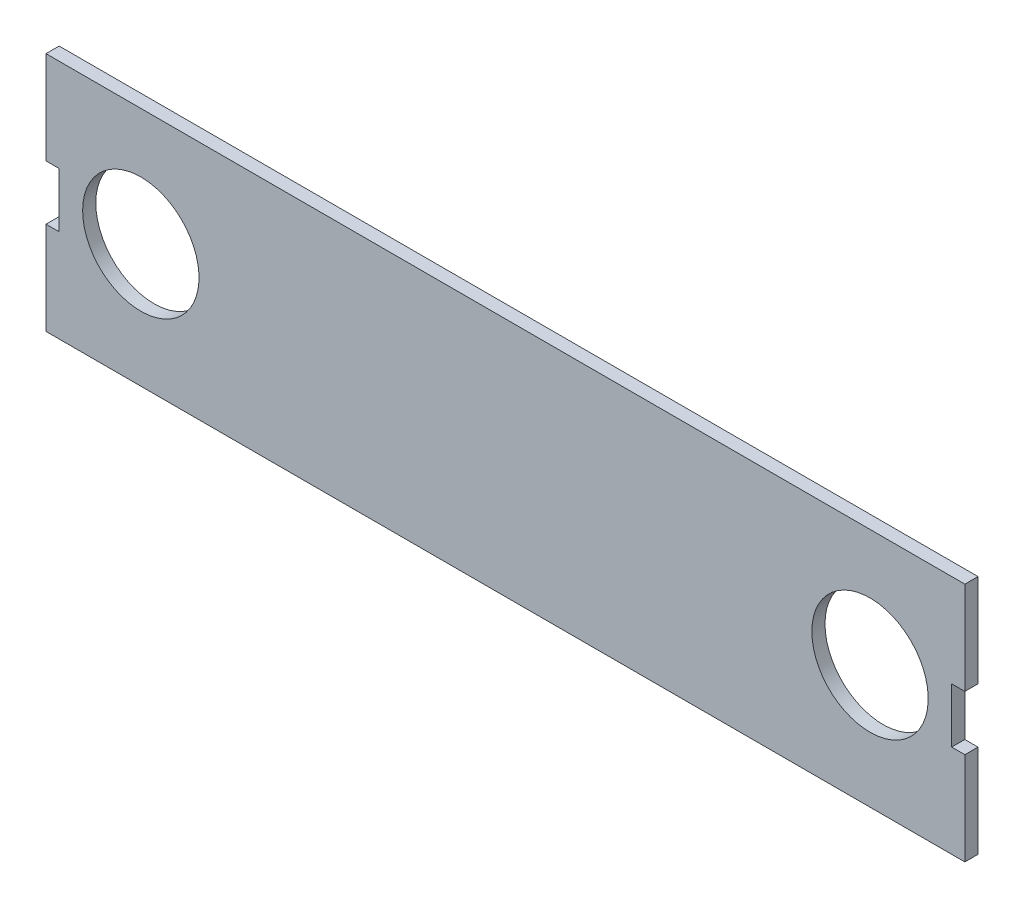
from build123d import *

# Parameters (mm, degrees)
SKETCH1_R           = 6.7437
BOSS_EXTRUDE1_DEPTH = 1.524


with BuildPart() as part:
    # Sketch1 → Boss-Extrude1 (new body)
    with BuildSketch(Plane.XY):
        Polygon((-1.524, -2.051280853), (0, -2.051280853), (0, -8.401280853), (-1.524, -8.401280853), (-1.524, -19.171774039), (104.993300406, -19.171774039), (104.993300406, -8.401280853), (103.469300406, -8.401280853), (103.469300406, -2.051280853), (104.993300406, -2.051280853), (104.993300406, 8.719212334), (-1.524, 8.719212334), align=None)
        with Locations(Location((9.468478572, -4.905028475, 0), (0, 0, 180))):
            Circle(SKETCH1_R, mode=Mode.SUBTRACT)
        with Locations(Location((94.000821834, -4.905028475, 0), (0, 0, 180))):
            Circle(SKETCH1_R, mode=Mode.SUBTRACT)
    extrude(amount=BOSS_EXTRUDE1_DEPTH)


solid = part.part
